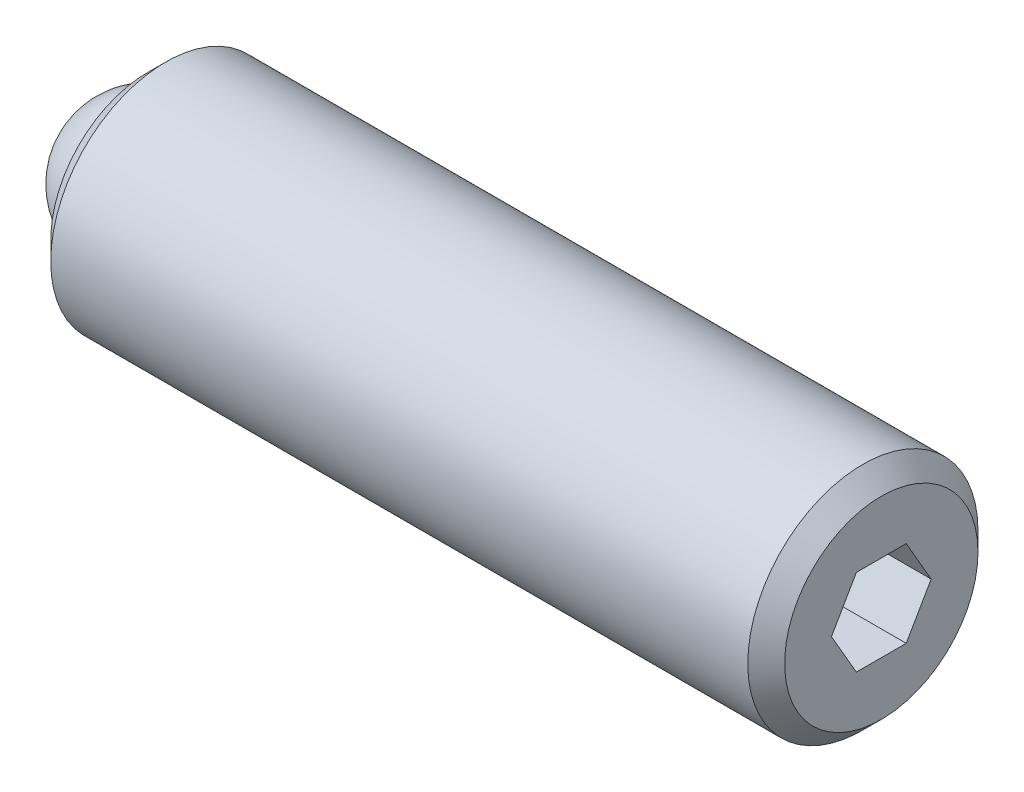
ISO-10303-21;
HEADER;
FILE_DESCRIPTION(('STEP AP214'),'2;1');
FILE_NAME('part.step','',(''),(''),'','','');
FILE_SCHEMA(('AUTOMOTIVE_DESIGN { 1 0 10303 214 1 1 1 1 }'));
ENDSEC;
DATA;
#1=APPLICATION_CONTEXT('core data for automotive mechanical design processes');
#2=APPLICATION_PROTOCOL_DEFINITION('international standard','automotive_design',2000,#1);
#3=PRODUCT_CONTEXT('',#1,'mechanical');
#4=PRODUCT('Part','Part','',(#3));
#5=PRODUCT_RELATED_PRODUCT_CATEGORY('part','',(#4));
#6=PRODUCT_DEFINITION_FORMATION('','',#4);
#7=PRODUCT_DEFINITION_CONTEXT('part definition',#1,'design');
#8=PRODUCT_DEFINITION('design','',#6,#7);
#9=PRODUCT_DEFINITION_SHAPE('','',#8);
#10=(LENGTH_UNIT() NAMED_UNIT(*) SI_UNIT(.MILLI.,.METRE.));
#11=(NAMED_UNIT(*) PLANE_ANGLE_UNIT() SI_UNIT($,.RADIAN.));
#12=(NAMED_UNIT(*) SI_UNIT($,.STERADIAN.) SOLID_ANGLE_UNIT());
#13=UNCERTAINTY_MEASURE_WITH_UNIT(LENGTH_MEASURE(1.E-05),#10,'distance_accuracy_value','');
#14=(GEOMETRIC_REPRESENTATION_CONTEXT(3) GLOBAL_UNCERTAINTY_ASSIGNED_CONTEXT((#13)) GLOBAL_UNIT_ASSIGNED_CONTEXT((#10,
#11,#12)) REPRESENTATION_CONTEXT('',''));
#15=CARTESIAN_POINT('',(0.,0.,0.));
#16=DIRECTION('',(0.,0.,1.));
#17=DIRECTION('',(1.,0.,0.));
#18=AXIS2_PLACEMENT_3D('',#15,#16,#17);
#19=CARTESIAN_POINT('',(0.,0.,0.));
#20=DIRECTION('',(0.,-1.,0.));
#21=DIRECTION('',(0.,0.,1.));
#22=AXIS2_PLACEMENT_3D('',#19,#20,#21);
#23=SPHERICAL_SURFACE('',#22,1.984375);
#24=CARTESIAN_POINT('',(0.,-1.984375,0.));
#25=VERTEX_POINT('',#24);
#26=VERTEX_LOOP('',#25);
#27=FACE_BOUND('',#26,.T.);
#28=ADVANCED_FACE('F41',(#27),#23,.T.);
#29=CLOSED_SHELL('',(#28));
#30=MANIFOLD_SOLID_BREP('B2',#29);
#31=CARTESIAN_POINT('',(20.240625,0.,0.));
#32=DIRECTION('',(-1.,0.,0.));
#33=DIRECTION('',(0.,0.,1.));
#34=AXIS2_PLACEMENT_3D('',#31,#32,#33);
#35=CYLINDRICAL_SURFACE('',#34,3.175);
#36=CARTESIAN_POINT('',(19.732625,0.,0.));
#37=DIRECTION('',(1.,0.,0.));
#38=DIRECTION('',(0.,0.,-1.));
#39=AXIS2_PLACEMENT_3D('',#36,#37,#38);
#40=CIRCLE('',#39,3.175);
#41=CARTESIAN_POINT('',(19.732625,0.,-3.175));
#42=VERTEX_POINT('',#41);
#43=EDGE_CURVE('E39',#42,#42,#40,.F.);
#44=ORIENTED_EDGE('',*,*,#43,.T.);
#45=EDGE_LOOP('',(#44));
#46=FACE_BOUND('',#45,.T.);
#47=CARTESIAN_POINT('',(0.508000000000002,0.,0.));
#48=DIRECTION('',(1.,0.,0.));
#49=DIRECTION('',(0.,0.,-1.));
#50=AXIS2_PLACEMENT_3D('',#47,#48,#49);
#51=CIRCLE('',#50,3.175);
#52=CARTESIAN_POINT('',(0.508000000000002,0.,-3.175));
#53=VERTEX_POINT('',#52);
#54=EDGE_CURVE('E157',#53,#53,#51,.T.);
#55=ORIENTED_EDGE('',*,*,#54,.T.);
#56=EDGE_LOOP('',(#55));
#57=FACE_BOUND('',#56,.T.);
#58=ADVANCED_FACE('F54',(#46,#57),#35,.T.);
#59=CARTESIAN_POINT('',(20.240625,0.,0.));
#60=DIRECTION('',(1.,0.,0.));
#61=DIRECTION('',(0.,0.,-1.));
#62=AXIS2_PLACEMENT_3D('',#59,#60,#61);
#63=PLANE('',#62);
#64=DIRECTION('',(0.,0.866025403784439,-0.5));
#65=VECTOR('',#64,1.);
#66=CARTESIAN_POINT('',(20.240625,-1.190625,-0.687407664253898));
#67=LINE('',#66,#65);
#68=CARTESIAN_POINT('',(20.240625,-1.190625,-0.687407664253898));
#69=VERTEX_POINT('',#68);
#70=CARTESIAN_POINT('',(20.240625,0.,-1.3748153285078));
#71=VERTEX_POINT('',#70);
#72=EDGE_CURVE('E69',#69,#71,#67,.T.);
#73=ORIENTED_EDGE('',*,*,#72,.F.);
#74=DIRECTION('',(0.,0.,-1.));
#75=VECTOR('',#74,1.);
#76=CARTESIAN_POINT('',(20.240625,-1.190625,0.687407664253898));
#77=LINE('',#76,#75);
#78=CARTESIAN_POINT('',(20.240625,-1.190625,0.687407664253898));
#79=VERTEX_POINT('',#78);
#80=EDGE_CURVE('E153',#79,#69,#77,.T.);
#81=ORIENTED_EDGE('',*,*,#80,.F.);
#82=DIRECTION('',(0.,-0.866025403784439,-0.5));
#83=VECTOR('',#82,1.);
#84=CARTESIAN_POINT('',(20.240625,0.,1.3748153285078));
#85=LINE('',#84,#83);
#86=CARTESIAN_POINT('',(20.240625,0.,1.3748153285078));
#87=VERTEX_POINT('',#86);
#88=EDGE_CURVE('E151',#87,#79,#85,.T.);
#89=ORIENTED_EDGE('',*,*,#88,.F.);
#90=DIRECTION('',(0.,-0.866025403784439,0.5));
#91=VECTOR('',#90,1.);
#92=CARTESIAN_POINT('',(20.240625,1.190625,0.687407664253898));
#93=LINE('',#92,#91);
#94=CARTESIAN_POINT('',(20.240625,1.190625,0.687407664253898));
#95=VERTEX_POINT('',#94);
#96=EDGE_CURVE('E117',#95,#87,#93,.T.);
#97=ORIENTED_EDGE('',*,*,#96,.F.);
#98=DIRECTION('',(0.,0.,1.));
#99=VECTOR('',#98,1.);
#100=CARTESIAN_POINT('',(20.240625,1.190625,-0.687407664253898));
#101=LINE('',#100,#99);
#102=CARTESIAN_POINT('',(20.240625,1.190625,-0.687407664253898));
#103=VERTEX_POINT('',#102);
#104=EDGE_CURVE('E147',#103,#95,#101,.T.);
#105=ORIENTED_EDGE('',*,*,#104,.F.);
#106=DIRECTION('',(0.,0.866025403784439,0.5));
#107=VECTOR('',#106,1.);
#108=CARTESIAN_POINT('',(20.240625,0.,-1.3748153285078));
#109=LINE('',#108,#107);
#110=EDGE_CURVE('E143',#71,#103,#109,.T.);
#111=ORIENTED_EDGE('',*,*,#110,.F.);
#112=EDGE_LOOP('',(#73,#81,#89,#97,#105,#111));
#113=FACE_BOUND('',#112,.T.);
#114=CARTESIAN_POINT('',(20.240625,0.,0.));
#115=DIRECTION('',(1.,0.,0.));
#116=DIRECTION('',(0.,0.,-1.));
#117=AXIS2_PLACEMENT_3D('',#114,#115,#116);
#118=CIRCLE('',#117,2.667);
#119=CARTESIAN_POINT('',(20.240625,0.,-2.667));
#120=VERTEX_POINT('',#119);
#121=EDGE_CURVE('E62',#120,#120,#118,.T.);
#122=ORIENTED_EDGE('',*,*,#121,.T.);
#123=EDGE_LOOP('',(#122));
#124=FACE_BOUND('',#123,.T.);
#125=ADVANCED_FACE('F170',(#113,#124),#63,.T.);
#126=CARTESIAN_POINT('',(0.,0.,0.));
#127=DIRECTION('',(1.,0.,0.));
#128=DIRECTION('',(0.,0.,-1.));
#129=AXIS2_PLACEMENT_3D('',#126,#127,#128);
#130=PLANE('',#129);
#131=CARTESIAN_POINT('',(0.,0.,0.));
#132=DIRECTION('',(-1.,0.,0.));
#133=DIRECTION('',(0.,0.,1.));
#134=AXIS2_PLACEMENT_3D('',#131,#132,#133);
#135=CIRCLE('',#134,1.9812);
#136=CARTESIAN_POINT('',(0.,0.,1.9812));
#137=VERTEX_POINT('',#136);
#138=EDGE_CURVE('E225',#137,#137,#135,.T.);
#139=ORIENTED_EDGE('',*,*,#138,.F.);
#140=EDGE_LOOP('',(#139));
#141=FACE_BOUND('',#140,.T.);
#142=CARTESIAN_POINT('',(0.,0.,0.));
#143=DIRECTION('',(1.,0.,0.));
#144=DIRECTION('',(0.,0.,-1.));
#145=AXIS2_PLACEMENT_3D('',#142,#143,#144);
#146=CIRCLE('',#145,2.667);
#147=CARTESIAN_POINT('',(0.,0.,-2.667));
#148=VERTEX_POINT('',#147);
#149=EDGE_CURVE('E165',#148,#148,#146,.F.);
#150=ORIENTED_EDGE('',*,*,#149,.T.);
#151=EDGE_LOOP('',(#150));
#152=FACE_BOUND('',#151,.T.);
#153=ADVANCED_FACE('F182',(#141,#152),#130,.F.);
#154=CARTESIAN_POINT('',(0.508000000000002,0.,0.));
#155=DIRECTION('',(1.,0.,0.));
#156=DIRECTION('',(0.,0.,-1.));
#157=AXIS2_PLACEMENT_3D('',#154,#155,#156);
#158=CONICAL_SURFACE('',#157,3.175,0.78539816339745);
#159=ORIENTED_EDGE('',*,*,#149,.F.);
#160=EDGE_LOOP('',(#159));
#161=FACE_BOUND('',#160,.T.);
#162=ORIENTED_EDGE('',*,*,#54,.F.);
#163=EDGE_LOOP('',(#162));
#164=FACE_BOUND('',#163,.T.);
#165=ADVANCED_FACE('F174',(#161,#164),#158,.T.);
#166=CARTESIAN_POINT('',(20.240625,0.,0.));
#167=DIRECTION('',(-1.,0.,0.));
#168=DIRECTION('',(0.,0.,1.));
#169=AXIS2_PLACEMENT_3D('',#166,#167,#168);
#170=CONICAL_SURFACE('',#169,2.667,0.785398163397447);
#171=ORIENTED_EDGE('',*,*,#43,.F.);
#172=EDGE_LOOP('',(#171));
#173=FACE_BOUND('',#172,.T.);
#174=ORIENTED_EDGE('',*,*,#121,.F.);
#175=EDGE_LOOP('',(#174));
#176=FACE_BOUND('',#175,.T.);
#177=ADVANCED_FACE('F56',(#173,#176),#170,.T.);
#178=CARTESIAN_POINT('',(17.954625,-1.190625,-0.687407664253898));
#179=DIRECTION('',(0.,-0.5,-0.866025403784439));
#180=DIRECTION('',(0.,0.866025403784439,-0.5));
#181=AXIS2_PLACEMENT_3D('',#178,#179,#180);
#182=PLANE('',#181);
#183=ORIENTED_EDGE('',*,*,#72,.T.);
#184=DIRECTION('',(1.,0.,0.));
#185=VECTOR('',#184,1.);
#186=CARTESIAN_POINT('',(17.954625,0.,-1.3748153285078));
#187=LINE('',#186,#185);
#188=CARTESIAN_POINT('',(17.954625,0.,-1.3748153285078));
#189=VERTEX_POINT('',#188);
#190=EDGE_CURVE('E99',#189,#71,#187,.T.);
#191=ORIENTED_EDGE('',*,*,#190,.F.);
#192=DIRECTION('',(0.,0.866025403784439,-0.5));
#193=VECTOR('',#192,1.);
#194=CARTESIAN_POINT('',(17.954625,-1.190625,-0.687407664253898));
#195=LINE('',#194,#193);
#196=CARTESIAN_POINT('',(17.954625,-1.190625,-0.687407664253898));
#197=VERTEX_POINT('',#196);
#198=EDGE_CURVE('E155',#197,#189,#195,.T.);
#199=ORIENTED_EDGE('',*,*,#198,.F.);
#200=DIRECTION('',(1.,0.,0.));
#201=VECTOR('',#200,1.);
#202=CARTESIAN_POINT('',(17.954625,-1.190625,-0.687407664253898));
#203=LINE('',#202,#201);
#204=EDGE_CURVE('E77',#197,#69,#203,.T.);
#205=ORIENTED_EDGE('',*,*,#204,.T.);
#206=EDGE_LOOP('',(#183,#191,#199,#205));
#207=FACE_BOUND('',#206,.T.);
#208=ADVANCED_FACE('F173',(#207),#182,.F.);
#209=CARTESIAN_POINT('',(17.954625,-1.190625,0.687407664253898));
#210=DIRECTION('',(0.,-1.,0.));
#211=DIRECTION('',(0.,0.,-1.));
#212=AXIS2_PLACEMENT_3D('',#209,#210,#211);
#213=PLANE('',#212);
#214=ORIENTED_EDGE('',*,*,#80,.T.);
#215=ORIENTED_EDGE('',*,*,#204,.F.);
#216=DIRECTION('',(0.,0.,-1.));
#217=VECTOR('',#216,1.);
#218=CARTESIAN_POINT('',(17.954625,-1.190625,0.687407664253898));
#219=LINE('',#218,#217);
#220=CARTESIAN_POINT('',(17.954625,-1.190625,0.687407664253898));
#221=VERTEX_POINT('',#220);
#222=EDGE_CURVE('E129',#221,#197,#219,.T.);
#223=ORIENTED_EDGE('',*,*,#222,.F.);
#224=DIRECTION('',(1.,0.,0.));
#225=VECTOR('',#224,1.);
#226=CARTESIAN_POINT('',(17.954625,-1.190625,0.687407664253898));
#227=LINE('',#226,#225);
#228=EDGE_CURVE('E121',#221,#79,#227,.T.);
#229=ORIENTED_EDGE('',*,*,#228,.T.);
#230=EDGE_LOOP('',(#214,#215,#223,#229));
#231=FACE_BOUND('',#230,.T.);
#232=ADVANCED_FACE('F180',(#231),#213,.F.);
#233=CARTESIAN_POINT('',(17.954625,0.,1.3748153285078));
#234=DIRECTION('',(0.,-0.5,0.866025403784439));
#235=DIRECTION('',(0.,-0.866025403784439,-0.5));
#236=AXIS2_PLACEMENT_3D('',#233,#234,#235);
#237=PLANE('',#236);
#238=ORIENTED_EDGE('',*,*,#88,.T.);
#239=ORIENTED_EDGE('',*,*,#228,.F.);
#240=DIRECTION('',(0.,-0.866025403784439,-0.5));
#241=VECTOR('',#240,1.);
#242=CARTESIAN_POINT('',(17.954625,0.,1.3748153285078));
#243=LINE('',#242,#241);
#244=CARTESIAN_POINT('',(17.954625,0.,1.3748153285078));
#245=VERTEX_POINT('',#244);
#246=EDGE_CURVE('E125',#245,#221,#243,.T.);
#247=ORIENTED_EDGE('',*,*,#246,.F.);
#248=DIRECTION('',(1.,0.,0.));
#249=VECTOR('',#248,1.);
#250=CARTESIAN_POINT('',(17.954625,0.,1.3748153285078));
#251=LINE('',#250,#249);
#252=EDGE_CURVE('E110',#245,#87,#251,.T.);
#253=ORIENTED_EDGE('',*,*,#252,.T.);
#254=EDGE_LOOP('',(#238,#239,#247,#253));
#255=FACE_BOUND('',#254,.T.);
#256=ADVANCED_FACE('F126',(#255),#237,.F.);
#257=CARTESIAN_POINT('',(17.954625,1.190625,0.687407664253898));
#258=DIRECTION('',(0.,0.5,0.866025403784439));
#259=DIRECTION('',(0.,-0.866025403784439,0.5));
#260=AXIS2_PLACEMENT_3D('',#257,#258,#259);
#261=PLANE('',#260);
#262=ORIENTED_EDGE('',*,*,#96,.T.);
#263=ORIENTED_EDGE('',*,*,#252,.F.);
#264=DIRECTION('',(0.,-0.866025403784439,0.5));
#265=VECTOR('',#264,1.);
#266=CARTESIAN_POINT('',(17.954625,1.190625,0.687407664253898));
#267=LINE('',#266,#265);
#268=CARTESIAN_POINT('',(17.954625,1.190625,0.687407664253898));
#269=VERTEX_POINT('',#268);
#270=EDGE_CURVE('E114',#269,#245,#267,.T.);
#271=ORIENTED_EDGE('',*,*,#270,.F.);
#272=DIRECTION('',(1.,0.,0.));
#273=VECTOR('',#272,1.);
#274=CARTESIAN_POINT('',(17.954625,1.190625,0.687407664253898));
#275=LINE('',#274,#273);
#276=EDGE_CURVE('E122',#269,#95,#275,.T.);
#277=ORIENTED_EDGE('',*,*,#276,.T.);
#278=EDGE_LOOP('',(#262,#263,#271,#277));
#279=FACE_BOUND('',#278,.T.);
#280=ADVANCED_FACE('F112',(#279),#261,.F.);
#281=CARTESIAN_POINT('',(17.954625,1.190625,-0.687407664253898));
#282=DIRECTION('',(0.,1.,0.));
#283=DIRECTION('',(0.,0.,1.));
#284=AXIS2_PLACEMENT_3D('',#281,#282,#283);
#285=PLANE('',#284);
#286=ORIENTED_EDGE('',*,*,#104,.T.);
#287=ORIENTED_EDGE('',*,*,#276,.F.);
#288=DIRECTION('',(0.,0.,1.));
#289=VECTOR('',#288,1.);
#290=CARTESIAN_POINT('',(17.954625,1.190625,-0.687407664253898));
#291=LINE('',#290,#289);
#292=CARTESIAN_POINT('',(17.954625,1.190625,-0.687407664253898));
#293=VERTEX_POINT('',#292);
#294=EDGE_CURVE('E135',#293,#269,#291,.T.);
#295=ORIENTED_EDGE('',*,*,#294,.F.);
#296=DIRECTION('',(1.,0.,0.));
#297=VECTOR('',#296,1.);
#298=CARTESIAN_POINT('',(17.954625,1.190625,-0.687407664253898));
#299=LINE('',#298,#297);
#300=EDGE_CURVE('E160',#293,#103,#299,.T.);
#301=ORIENTED_EDGE('',*,*,#300,.T.);
#302=EDGE_LOOP('',(#286,#287,#295,#301));
#303=FACE_BOUND('',#302,.T.);
#304=ADVANCED_FACE('F201',(#303),#285,.F.);
#305=CARTESIAN_POINT('',(17.954625,0.,-1.3748153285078));
#306=DIRECTION('',(0.,0.5,-0.866025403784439));
#307=DIRECTION('',(0.,0.866025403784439,0.5));
#308=AXIS2_PLACEMENT_3D('',#305,#306,#307);
#309=PLANE('',#308);
#310=ORIENTED_EDGE('',*,*,#110,.T.);
#311=ORIENTED_EDGE('',*,*,#300,.F.);
#312=DIRECTION('',(0.,0.866025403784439,0.5));
#313=VECTOR('',#312,1.);
#314=CARTESIAN_POINT('',(17.954625,0.,-1.3748153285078));
#315=LINE('',#314,#313);
#316=EDGE_CURVE('E137',#189,#293,#315,.T.);
#317=ORIENTED_EDGE('',*,*,#316,.F.);
#318=ORIENTED_EDGE('',*,*,#190,.T.);
#319=EDGE_LOOP('',(#310,#311,#317,#318));
#320=FACE_BOUND('',#319,.T.);
#321=ADVANCED_FACE('F198',(#320),#309,.F.);
#322=CARTESIAN_POINT('',(17.954625,0.,0.));
#323=DIRECTION('',(1.,0.,0.));
#324=DIRECTION('',(0.,0.,-1.));
#325=AXIS2_PLACEMENT_3D('',#322,#323,#324);
#326=PLANE('',#325);
#327=ORIENTED_EDGE('',*,*,#198,.T.);
#328=ORIENTED_EDGE('',*,*,#316,.T.);
#329=ORIENTED_EDGE('',*,*,#294,.T.);
#330=ORIENTED_EDGE('',*,*,#270,.T.);
#331=ORIENTED_EDGE('',*,*,#246,.T.);
#332=ORIENTED_EDGE('',*,*,#222,.T.);
#333=EDGE_LOOP('',(#327,#328,#329,#330,#331,#332));
#334=FACE_BOUND('',#333,.T.);
#335=ADVANCED_FACE('F132',(#334),#326,.T.);
#336=CARTESIAN_POINT('',(1.984375,0.,0.));
#337=DIRECTION('',(-1.,0.,0.));
#338=DIRECTION('',(0.,0.,1.));
#339=AXIS2_PLACEMENT_3D('',#336,#337,#338);
#340=CYLINDRICAL_SURFACE('',#339,1.9812);
#341=CARTESIAN_POINT('',(1.984375,0.,0.));
#342=DIRECTION('',(-1.,0.,0.));
#343=DIRECTION('',(0.,0.,1.));
#344=AXIS2_PLACEMENT_3D('',#341,#342,#343);
#345=CIRCLE('',#344,1.9812);
#346=CARTESIAN_POINT('',(1.984375,0.,1.9812));
#347=VERTEX_POINT('',#346);
#348=EDGE_CURVE('E144',#347,#347,#345,.T.);
#349=ORIENTED_EDGE('',*,*,#348,.F.);
#350=EDGE_LOOP('',(#349));
#351=FACE_BOUND('',#350,.T.);
#352=ORIENTED_EDGE('',*,*,#138,.T.);
#353=EDGE_LOOP('',(#352));
#354=FACE_BOUND('',#353,.T.);
#355=ADVANCED_FACE('F214',(#351,#354),#340,.F.);
#356=CARTESIAN_POINT('',(1.984375,0.,0.));
#357=DIRECTION('',(-1.,0.,0.));
#358=DIRECTION('',(0.,0.,1.));
#359=AXIS2_PLACEMENT_3D('',#356,#357,#358);
#360=PLANE('',#359);
#361=ORIENTED_EDGE('',*,*,#348,.T.);
#362=EDGE_LOOP('',(#361));
#363=FACE_BOUND('',#362,.T.);
#364=ADVANCED_FACE('F217',(#363),#360,.T.);
#365=CLOSED_SHELL('',(#58,#125,#153,#165,#177,#208,#232,#256,#280,#304,#321,#335,#355,#364));
#366=MANIFOLD_SOLID_BREP('B6',#365);
#367=ADVANCED_BREP_SHAPE_REPRESENTATION('',(#18,#30,#366),#14);
#368=SHAPE_DEFINITION_REPRESENTATION(#9,#367);
ENDSEC;
END-ISO-10303-21;
